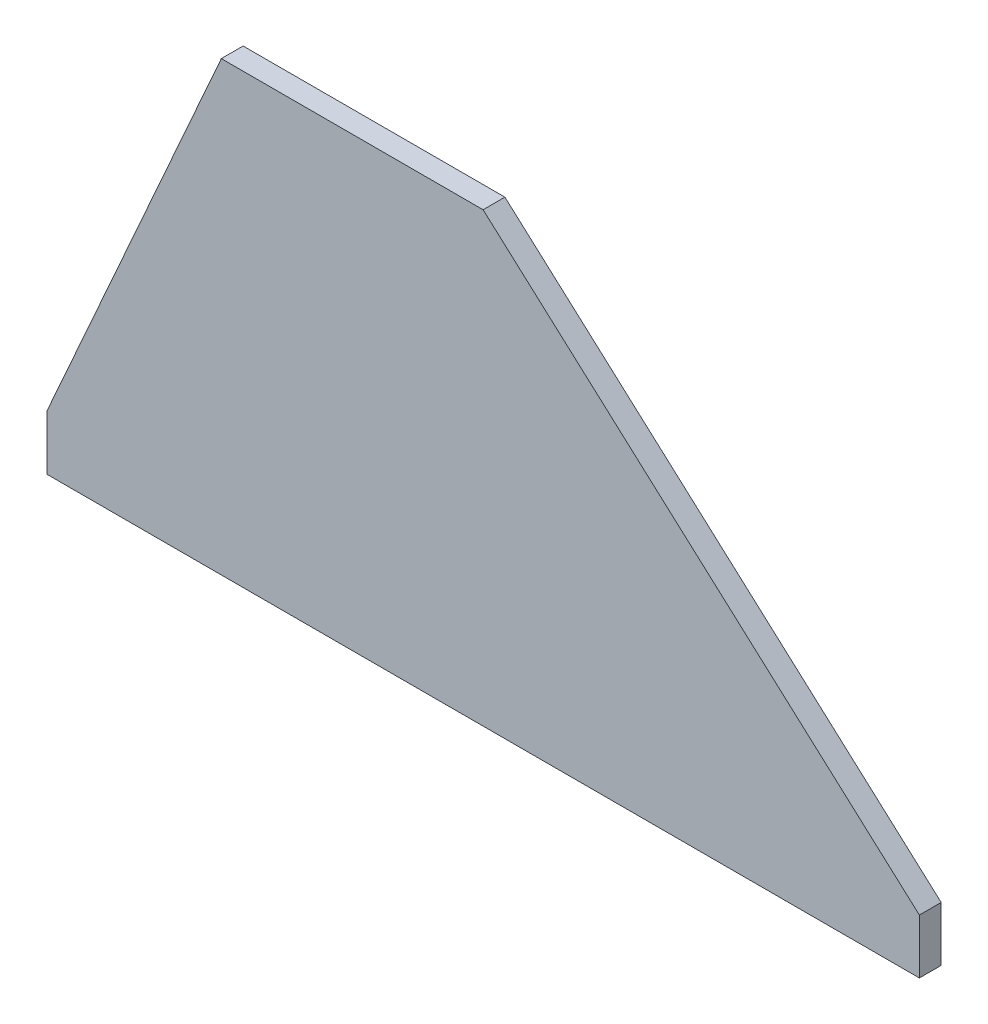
from build123d import *

# Parameters (mm, degrees)
EXTRUDE1_DEPTH = 3.175


with BuildPart() as part:
    # Sketch2 → Extrude1 (new body)
    with BuildSketch(Plane.XY):
        Polygon((127, 0), (63.5, 57.15), (25.4, 57.15), (0, 0), (0, -7.9375), (127, -7.9375), align=None)
    extrude(amount=EXTRUDE1_DEPTH)


solid = part.part
